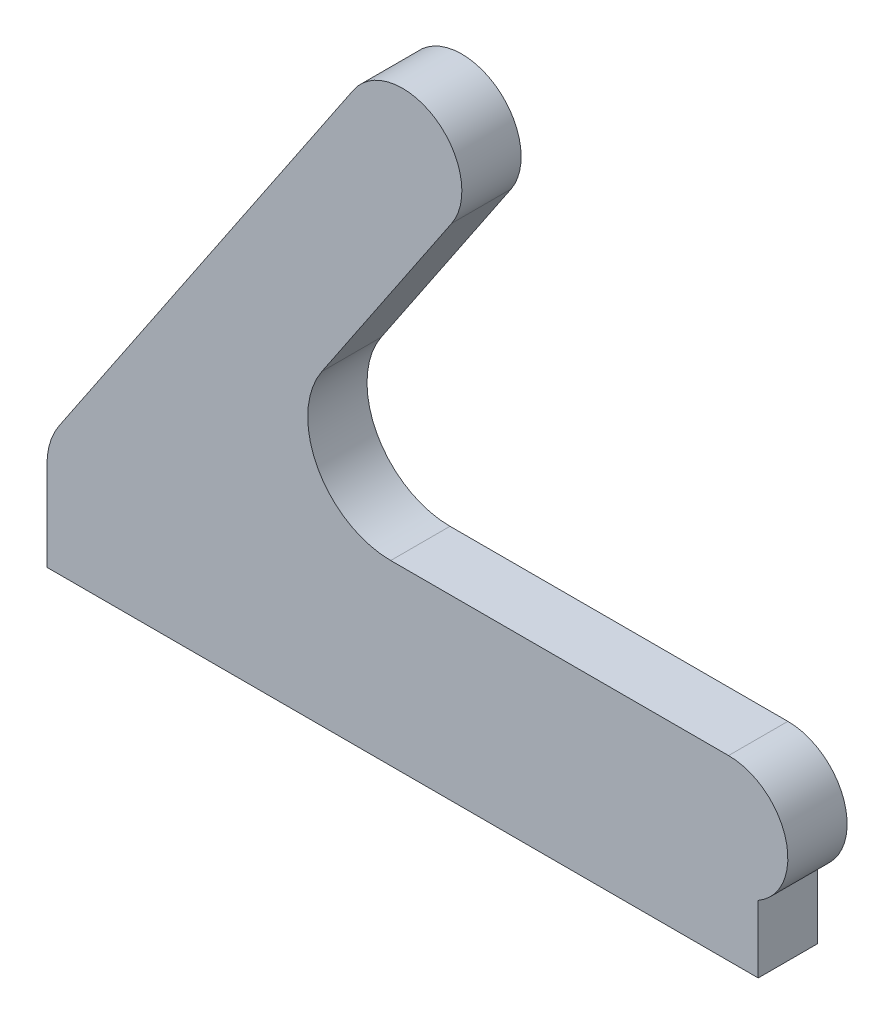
from build123d import *

# Parameters (mm, degrees)
BOSS_EXTRU_1_DEPTH = 10


with BuildPart() as part:
    # Esquisse1 → Boss.-Extru.1 (new body)
    with BuildSketch(Plane.XY):
        with BuildLine():
            Line((0, 0), (120, 0))
            Line((120, 0), (120, 11.339745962))
            ThreePointArc((120, 11.339745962), (124.659258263, 22.588190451), (115, 30))
            Line((115, 30), (57.999355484, 30))
            ThreePointArc((57.999355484, 30), (45.643470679, 37.417286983), (46.380034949, 51.809698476))
            Line((46.380034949, 51.809698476), (68.299514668, 84.421643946))
            ThreePointArc((68.299514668, 84.421643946), (65.578356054, 98.299514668), (51.700485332, 95.578356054))
            Line((51.700485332, 95.578356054), (2.040582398, 21.694027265))
            ThreePointArc((2.040582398, 21.694027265), (0.521476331, 18.499070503), (0, 15))
            Line((0, 15), (0, 0))
        make_face()
    extrude(amount=BOSS_EXTRU_1_DEPTH)


solid = part.part
